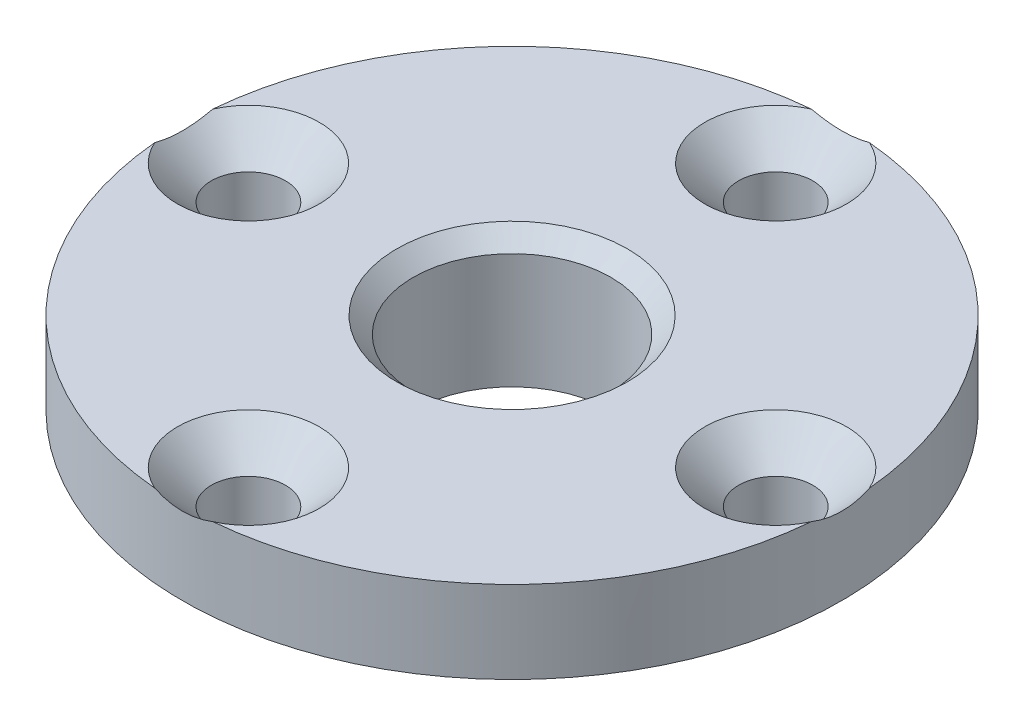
from build123d import *

# Parameters (mm, degrees)
FRAISAGE_POUR_VIS_T_TE_FRAIS_E_6_PAN_D           = 4.5
FRAISAGE_POUR_VIS_T_TE_FRAIS_E_6_PAN_CSINK_D     = 8.6
FRAISAGE_POUR_VIS_T_TE_FRAIS_E_6_PAN_CSINK_ANGLE = 90
R_P_TITION_CIRCULAIRE1_COUNT                     = 4
CHANFREIN3_SIZE                                  = 0.288675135
CHANFREIN3_SIZE2                                 = 0.5
CHANFREIN4_SIZE                                  = 1


with BuildPart() as part:
    # Esquisse2 → R_volution2 (revolve)
    with BuildSketch(Plane(origin=(0, 0, 0), x_dir=(0, 0, -1), z_dir=(1, 0, 0)), mode=Mode.PRIVATE) as r_volution2_sk:
        Polygon((-6, 0), (-13.4, 0), (-13.4, 3), (-20, 3), (-20, 8), (-6, 8), align=None)
    revolve(r_volution2_sk.sketch.rotate(Axis((0, -6.718470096, 0), (0, 1, 0)), 180), axis=Axis((0, -6.718470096, 0), (0, 1, 0)))

    # Fraisage pour vis _ t_te frais_e _ 6 pan (through all)
    with Locations(Plane(origin=(0, 8, 16), x_dir=(0, 0, 1), z_dir=(0, 1, 0))):
        with Locations((0, 0)):
            fraisage_pour_vis_t_te_frais_e_6_pan = CounterSinkHole(FRAISAGE_POUR_VIS_T_TE_FRAIS_E_6_PAN_D / 2, FRAISAGE_POUR_VIS_T_TE_FRAIS_E_6_PAN_CSINK_D / 2, counter_sink_angle=FRAISAGE_POUR_VIS_T_TE_FRAIS_E_6_PAN_CSINK_ANGLE)

    # R_p_tition circulaire1: Fraisage pour vis _ t_te frais_e _ 6 pan ×4 about axis
    r_p_tition_circulaire1_axis = Axis((0, 0, 0), (0, 1, 0))
    for i in range(1, R_P_TITION_CIRCULAIRE1_COUNT):
        add(fraisage_pour_vis_t_te_frais_e_6_pan.rotate(r_p_tition_circulaire1_axis, i * 360 / R_P_TITION_CIRCULAIRE1_COUNT), mode=Mode.SUBTRACT)

    # Chanfrein3
    chanfrein3_edges = [part.edges().sort_by_distance(p)[0] for p in [
        (0, 0, 13.4),
    ]]
    chanfrein3_side = [part.faces().sort_by_distance(p)[0] for p in [
        (0, 0, 6.379009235),
    ]]
    chamfer(chanfrein3_edges, length=CHANFREIN3_SIZE, length2=CHANFREIN3_SIZE2, reference=chanfrein3_side[0])

    # Chanfrein4
    chanfrein4_edges = [part.edges().sort_by_distance(p)[0] for p in [
        (0, 8, 6),
    ]]
    chamfer(chanfrein4_edges, length=CHANFREIN4_SIZE)


solid = part.part
